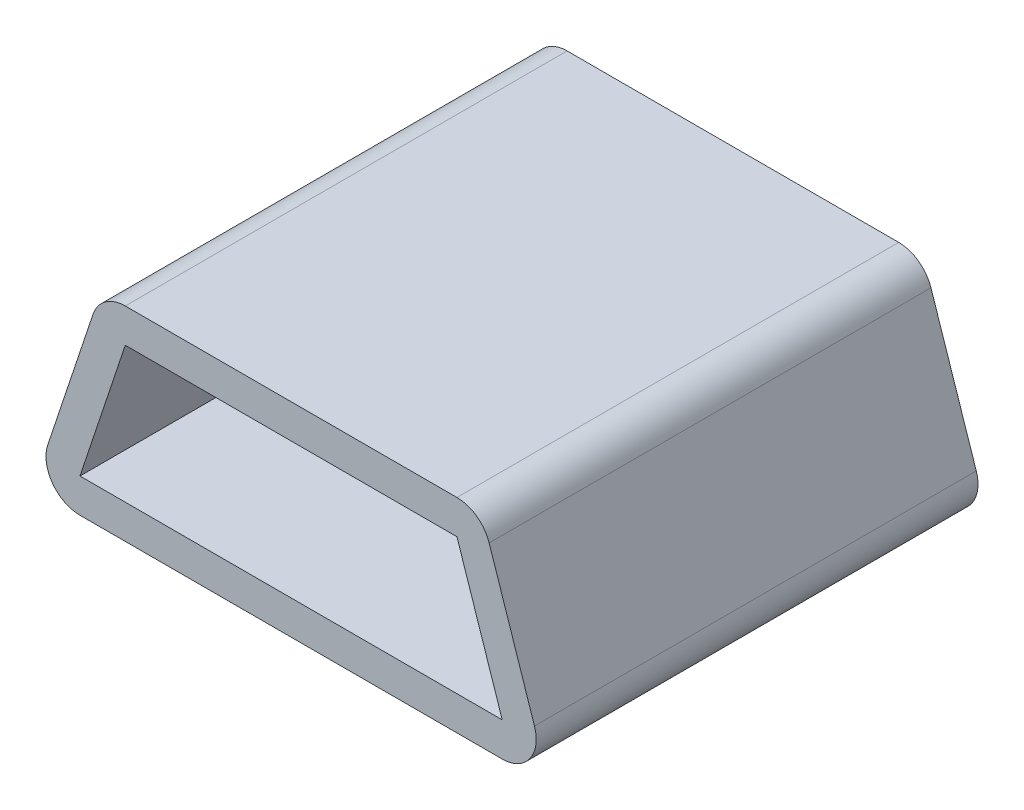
from build123d import *

# Parameters (mm, degrees)
EXTRUDE_1_DEPTH = 6.5
SHELL_2_T       = -0.5
FILLET_1_R      = 0.5


with BuildPart() as part:
    # Sketch 1 → Extrude 1 (new body)
    with BuildSketch(Plane.XY):
        Polygon((-3.8, 0), (3.8, 0), (2.8, 3), (-2.8, 3), align=None)
    extrude(amount=EXTRUDE_1_DEPTH)

    # Shell 2
    shell_2_openings = [part.faces().sort_by_distance(p)[0] for p in [
        (0, 1.424242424, 6.5),
    ]]
    offset(amount=SHELL_2_T, openings=shell_2_openings, kind=Kind.INTERSECTION)

    # Fillet 1
    fillet_1_edges = [part.edges().sort_by_distance(p)[0] for p in [
        (3.8, 0, 3.25),
        (-3.8, 0, 3.25),
        (-2.8, 3, 3.25),
        (2.8, 3, 3.25),
    ]]
    fillet(fillet_1_edges, radius=FILLET_1_R)


solid = part.part
